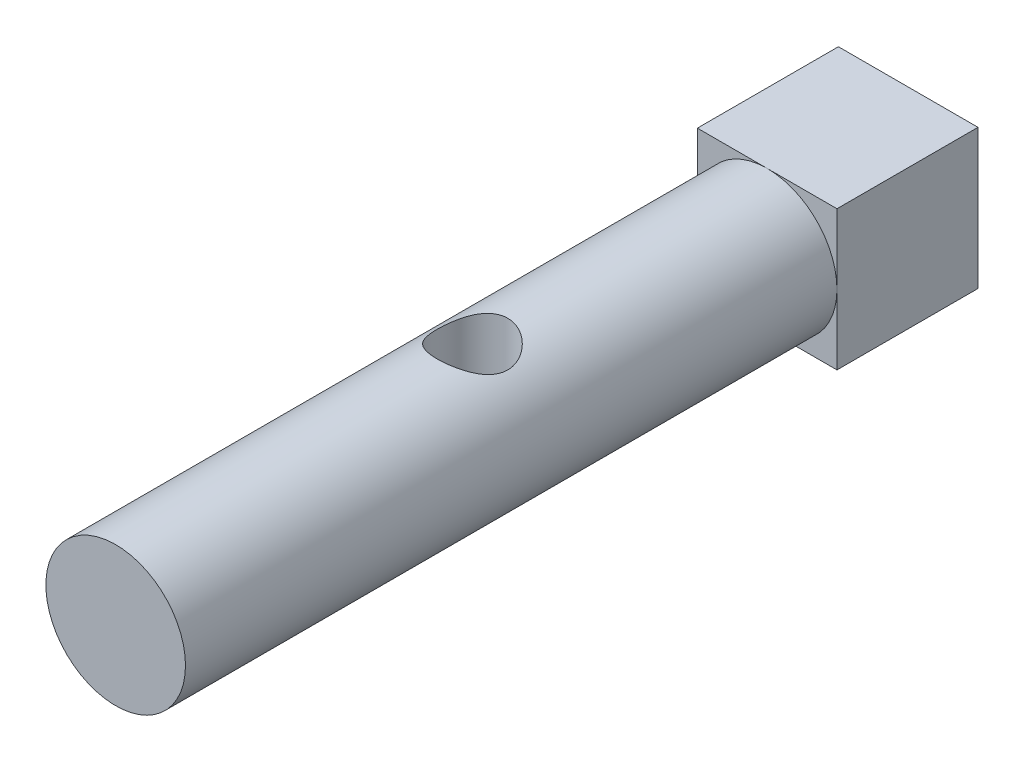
ISO-10303-21;
HEADER;
FILE_DESCRIPTION(('STEP AP214'),'2;1');
FILE_NAME('part.step','',(''),(''),'','','');
FILE_SCHEMA(('AUTOMOTIVE_DESIGN { 1 0 10303 214 1 1 1 1 }'));
ENDSEC;
DATA;
#1=APPLICATION_CONTEXT('core data for automotive mechanical design processes');
#2=APPLICATION_PROTOCOL_DEFINITION('international standard','automotive_design',2000,#1);
#3=PRODUCT_CONTEXT('',#1,'mechanical');
#4=PRODUCT('Part','Part','',(#3));
#5=PRODUCT_RELATED_PRODUCT_CATEGORY('part','',(#4));
#6=PRODUCT_DEFINITION_FORMATION('','',#4);
#7=PRODUCT_DEFINITION_CONTEXT('part definition',#1,'design');
#8=PRODUCT_DEFINITION('design','',#6,#7);
#9=PRODUCT_DEFINITION_SHAPE('','',#8);
#10=(LENGTH_UNIT() NAMED_UNIT(*) SI_UNIT(.MILLI.,.METRE.));
#11=(NAMED_UNIT(*) PLANE_ANGLE_UNIT() SI_UNIT($,.RADIAN.));
#12=(NAMED_UNIT(*) SI_UNIT($,.STERADIAN.) SOLID_ANGLE_UNIT());
#13=UNCERTAINTY_MEASURE_WITH_UNIT(LENGTH_MEASURE(1.E-05),#10,'distance_accuracy_value','');
#14=(GEOMETRIC_REPRESENTATION_CONTEXT(3) GLOBAL_UNCERTAINTY_ASSIGNED_CONTEXT((#13)) GLOBAL_UNIT_ASSIGNED_CONTEXT((#10,
#11,#12)) REPRESENTATION_CONTEXT('',''));
#15=CARTESIAN_POINT('',(0.,0.,0.));
#16=DIRECTION('',(0.,0.,1.));
#17=DIRECTION('',(1.,0.,0.));
#18=AXIS2_PLACEMENT_3D('',#15,#16,#17);
#19=CARTESIAN_POINT('',(0.,0.,46.2));
#20=DIRECTION('',(0.,0.,-1.));
#21=DIRECTION('',(-1.,0.,0.));
#22=AXIS2_PLACEMENT_3D('',#19,#20,#21);
#23=CYLINDRICAL_SURFACE('',#22,4.95);
#24=CARTESIAN_POINT('',(0.,0.,46.2));
#25=DIRECTION('',(0.,0.,1.));
#26=DIRECTION('',(1.,0.,0.));
#27=AXIS2_PLACEMENT_3D('',#24,#25,#26);
#28=CIRCLE('',#27,4.95);
#29=CARTESIAN_POINT('',(4.95,0.,46.2));
#30=VERTEX_POINT('',#29);
#31=EDGE_CURVE('E56',#30,#30,#28,.T.);
#32=ORIENTED_EDGE('',*,*,#31,.F.);
#33=EDGE_LOOP('',(#32));
#34=FACE_BOUND('',#33,.T.);
#35=CARTESIAN_POINT('',(0.,0.,0.));
#36=DIRECTION('',(0.,0.,1.));
#37=DIRECTION('',(1.,0.,0.));
#38=AXIS2_PLACEMENT_3D('',#35,#36,#37);
#39=CIRCLE('',#38,4.95);
#40=CARTESIAN_POINT('',(4.95,0.,0.));
#41=VERTEX_POINT('',#40);
#42=CARTESIAN_POINT('',(0.,4.95,0.));
#43=VERTEX_POINT('',#42);
#44=EDGE_CURVE('E137',#41,#43,#39,.T.);
#45=ORIENTED_EDGE('',*,*,#44,.T.);
#46=CARTESIAN_POINT('',(-4.95,0.,0.));
#47=VERTEX_POINT('',#46);
#48=EDGE_CURVE('E71',#43,#47,#39,.T.);
#49=ORIENTED_EDGE('',*,*,#48,.T.);
#50=CARTESIAN_POINT('',(0.,-4.95,0.));
#51=VERTEX_POINT('',#50);
#52=EDGE_CURVE('E136',#47,#51,#39,.T.);
#53=ORIENTED_EDGE('',*,*,#52,.T.);
#54=EDGE_CURVE('E131',#51,#41,#39,.T.);
#55=ORIENTED_EDGE('',*,*,#54,.T.);
#56=EDGE_LOOP('',(#45,#49,#53,#55));
#57=FACE_BOUND('',#56,.T.);
#58=CARTESIAN_POINT('',(0.,-4.95,18.4));
#59=CARTESIAN_POINT('',(0.131266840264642,-4.94999163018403,18.4000098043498));
#60=CARTESIAN_POINT('',(0.262691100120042,-4.94472218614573,18.4104001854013));
#61=CARTESIAN_POINT('',(0.52164224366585,-4.92415928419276,18.4515008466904));
#62=CARTESIAN_POINT('',(0.649161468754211,-4.90884730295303,18.482248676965));
#63=CARTESIAN_POINT('',(0.896167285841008,-4.86980082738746,18.5625479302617));
#64=CARTESIAN_POINT('',(1.01568317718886,-4.84609930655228,18.6120257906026));
#65=CARTESIAN_POINT('',(1.2445343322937,-4.7924387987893,18.7279947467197));
#66=CARTESIAN_POINT('',(1.3538702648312,-4.76248022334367,18.7944847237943));
#67=CARTESIAN_POINT('',(1.56680440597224,-4.69689097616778,18.9472249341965));
#68=CARTESIAN_POINT('',(1.66963889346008,-4.66102506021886,19.0344373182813));
#69=CARTESIAN_POINT('',(1.85992756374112,-4.58841603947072,19.2240713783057));
#70=CARTESIAN_POINT('',(1.9473697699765,-4.55167227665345,19.3265047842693));
#71=CARTESIAN_POINT('',(2.1113708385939,-4.47809362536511,19.5534373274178));
#72=CARTESIAN_POINT('',(2.18651095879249,-4.4414839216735,19.6790434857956));
#73=CARTESIAN_POINT('',(2.31428309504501,-4.37627389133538,19.9431473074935));
#74=CARTESIAN_POINT('',(2.36693142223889,-4.34766776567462,20.0816355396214));
#75=CARTESIAN_POINT('',(2.44476119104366,-4.3043619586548,20.3590644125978));
#76=CARTESIAN_POINT('',(2.47140889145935,-4.2889270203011,20.4974730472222));
#77=CARTESIAN_POINT('',(2.50095837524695,-4.27177176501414,20.7775851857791));
#78=CARTESIAN_POINT('',(2.50388449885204,-4.27003739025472,20.9192851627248));
#79=CARTESIAN_POINT('',(2.48698236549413,-4.27989017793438,21.1832639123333));
#80=CARTESIAN_POINT('',(2.46990048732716,-4.28986979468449,21.3057933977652));
#81=CARTESIAN_POINT('',(2.41823520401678,-4.31920271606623,21.5459334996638));
#82=CARTESIAN_POINT('',(2.38364603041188,-4.33855911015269,21.6635424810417));
#83=CARTESIAN_POINT('',(2.2973295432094,-4.38488447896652,21.8938636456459));
#84=CARTESIAN_POINT('',(2.24522257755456,-4.4120199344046,22.0063984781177));
#85=CARTESIAN_POINT('',(2.12564350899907,-4.47085852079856,22.2216727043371));
#86=CARTESIAN_POINT('',(2.0581644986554,-4.5025637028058,22.3244076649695));
#87=CARTESIAN_POINT('',(1.89955403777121,-4.57193747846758,22.5311961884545));
#88=CARTESIAN_POINT('',(1.80648987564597,-4.60984613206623,22.6336920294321));
#89=CARTESIAN_POINT('',(1.60435734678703,-4.68402933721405,22.8222785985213));
#90=CARTESIAN_POINT('',(1.49528107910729,-4.72030307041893,22.908361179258));
#91=CARTESIAN_POINT('',(1.25756302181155,-4.78926480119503,23.0655929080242));
#92=CARTESIAN_POINT('',(1.12823094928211,-4.82169519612,23.1358206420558));
#93=CARTESIAN_POINT('',(0.857536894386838,-4.87710504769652,23.2529402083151));
#94=CARTESIAN_POINT('',(0.71618475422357,-4.90009214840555,23.2998509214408));
#95=CARTESIAN_POINT('',(0.438181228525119,-4.93238401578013,23.3650843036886));
#96=CARTESIAN_POINT('',(0.30213110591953,-4.94267525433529,23.3854760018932));
#97=CARTESIAN_POINT('',(0.0281715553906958,-4.95181311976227,23.4036020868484));
#98=CARTESIAN_POINT('',(-0.109736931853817,-4.95066533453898,23.401347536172));
#99=CARTESIAN_POINT('',(-0.371843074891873,-4.9376202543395,23.3754180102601));
#100=CARTESIAN_POINT('',(-0.49625967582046,-4.92658406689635,23.3534587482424));
#101=CARTESIAN_POINT('',(-0.73938404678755,-4.89600136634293,23.291454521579));
#102=CARTESIAN_POINT('',(-0.858091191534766,-4.87645392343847,23.2514075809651));
#103=CARTESIAN_POINT('',(-1.09030613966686,-4.8299233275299,23.1533465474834));
#104=CARTESIAN_POINT('',(-1.2035735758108,-4.80274638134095,23.0948584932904));
#105=CARTESIAN_POINT('',(-1.41905476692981,-4.74355240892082,22.9621146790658));
#106=CARTESIAN_POINT('',(-1.52126383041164,-4.71153334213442,22.8878522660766));
#107=CARTESIAN_POINT('',(-1.72253892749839,-4.64196040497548,22.7171313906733));
#108=CARTESIAN_POINT('',(-1.82027549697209,-4.60417299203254,22.6191981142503));
#109=CARTESIAN_POINT('',(-1.99854026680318,-4.52964582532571,22.4082848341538));
#110=CARTESIAN_POINT('',(-2.07905596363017,-4.49290684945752,22.2952939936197));
#111=CARTESIAN_POINT('',(-2.22448661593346,-4.42278373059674,22.0502060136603));
#112=CARTESIAN_POINT('',(-2.28839379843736,-4.38966705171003,21.9174274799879));
#113=CARTESIAN_POINT('',(-2.39227317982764,-4.3339420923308,21.6407979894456));
#114=CARTESIAN_POINT('',(-2.43227681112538,-4.31132002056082,21.4969618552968));
#115=CARTESIAN_POINT('',(-2.48347550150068,-4.28201380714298,21.2171428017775));
#116=CARTESIAN_POINT('',(-2.4970797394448,-4.27400139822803,21.0817430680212));
#117=CARTESIAN_POINT('',(-2.50207080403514,-4.27108454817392,20.8104190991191));
#118=CARTESIAN_POINT('',(-2.49346793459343,-4.27617402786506,20.6744951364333));
#119=CARTESIAN_POINT('',(-2.45655227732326,-4.29746659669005,20.4201883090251));
#120=CARTESIAN_POINT('',(-2.4302750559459,-4.31251957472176,20.3014010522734));
#121=CARTESIAN_POINT('',(-2.36131008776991,-4.35066181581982,20.0700640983));
#122=CARTESIAN_POINT('',(-2.31861697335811,-4.37375370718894,19.9575164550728));
#123=CARTESIAN_POINT('',(-2.21483814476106,-4.42725742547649,19.7334909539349));
#124=CARTESIAN_POINT('',(-2.1527113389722,-4.45805617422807,19.6225905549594));
#125=CARTESIAN_POINT('',(-2.01296296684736,-4.52287682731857,19.4120599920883));
#126=CARTESIAN_POINT('',(-1.93533325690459,-4.55690042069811,19.3124357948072));
#127=CARTESIAN_POINT('',(-1.75541032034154,-4.62942291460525,19.1143378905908));
#128=CARTESIAN_POINT('',(-1.65124768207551,-4.6679500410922,19.0175618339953));
#129=CARTESIAN_POINT('',(-1.42716227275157,-4.74126842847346,18.8424645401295));
#130=CARTESIAN_POINT('',(-1.30723085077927,-4.77605761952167,18.7641534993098));
#131=CARTESIAN_POINT('',(-1.05286786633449,-4.83851121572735,18.6279065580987));
#132=CARTESIAN_POINT('',(-0.91831122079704,-4.8661059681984,18.5701679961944));
#133=CARTESIAN_POINT('',(-0.709589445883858,-4.89938589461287,18.5016962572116));
#134=CARTESIAN_POINT('',(-0.638918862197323,-4.90912324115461,18.4819024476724));
#135=CARTESIAN_POINT('',(-0.49579553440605,-4.92563264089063,18.4485571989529));
#136=CARTESIAN_POINT('',(-0.423343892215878,-4.93240648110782,18.4350019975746));
#137=CARTESIAN_POINT('',(-0.292418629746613,-4.94169659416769,18.4164713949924));
#138=CARTESIAN_POINT('',(-0.234152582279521,-4.94480361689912,18.4103014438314));
#139=CARTESIAN_POINT('',(-0.117268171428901,-4.94895721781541,18.4020634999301));
#140=CARTESIAN_POINT('',(-0.0586497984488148,-4.95000373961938,18.3999956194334));
#141=CARTESIAN_POINT('',(0.,-4.95,18.4));
#142=B_SPLINE_CURVE_WITH_KNOTS('',3,(#58,#59,#60,#61,#62,#63,#64,#65,#66,#67,#68,#69,#70,#71,
#72,#73,#74,#75,#76,#77,#78,#79,#80,#81,#82,#83,#84,#85,#86,#87,#88,#89,#90,#91,#92,#93,#94,#95,
#96,#97,#98,#99,#100,#101,#102,#103,#104,#105,#106,#107,#108,#109,#110,#111,#112,#113,#114,#115,
#116,#117,#118,#119,#120,#121,#122,#123,#124,#125,#126,#127,#128,#129,#130,#131,#132,#133,#134,
#135,#136,#137,#138,#139,#140,#141),.UNSPECIFIED.,.T.,.F.,(4,2,2,2,2,2,2,2,2,2,2,2,2,2,2,2,2,2,
2,2,2,2,2,2,2,2,2,2,2,2,2,2,2,2,2,2,2,2,2,2,2,4),(0.,0.393572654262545,0.787873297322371,
1.18064111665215,1.5733831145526,1.99022374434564,2.40738729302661,2.85772981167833,
3.30774518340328,3.73059394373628,4.1530087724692,4.52362263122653,4.89435868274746,
5.27371167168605,5.65323546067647,6.08199139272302,6.51095960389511,6.96063421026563,
7.40994409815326,7.8215415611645,8.23293797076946,8.61165594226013,8.99041529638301,
9.37983479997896,9.76941887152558,10.1978467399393,10.6265846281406,11.077236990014,
11.5272954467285,11.9338874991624,12.3402909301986,12.7064610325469,13.0727509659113,
13.4635949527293,13.8546447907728,14.2945339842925,14.7346655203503,15.1789119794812,
15.4007292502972,15.6224125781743,15.7982553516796,15.9741029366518),.UNSPECIFIED.);
#143=CARTESIAN_POINT('',(0.,-4.95,18.4));
#144=VERTEX_POINT('',#143);
#145=EDGE_CURVE('E11',#144,#144,#142,.T.);
#146=ORIENTED_EDGE('',*,*,#145,.F.);
#147=EDGE_LOOP('',(#146));
#148=FACE_BOUND('',#147,.T.);
#149=CARTESIAN_POINT('',(0.,4.95,18.4));
#150=CARTESIAN_POINT('',(0.131266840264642,4.94999163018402,18.4000098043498));
#151=CARTESIAN_POINT('',(0.262691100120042,4.94472218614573,18.4104001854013));
#152=CARTESIAN_POINT('',(0.521642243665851,4.92415928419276,18.4515008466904));
#153=CARTESIAN_POINT('',(0.649161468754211,4.90884730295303,18.482248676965));
#154=CARTESIAN_POINT('',(0.896167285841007,4.86980082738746,18.5625479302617));
#155=CARTESIAN_POINT('',(1.01568317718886,4.84609930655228,18.6120257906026));
#156=CARTESIAN_POINT('',(1.2445343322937,4.7924387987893,18.7279947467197));
#157=CARTESIAN_POINT('',(1.3538702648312,4.76248022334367,18.7944847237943));
#158=CARTESIAN_POINT('',(1.56680440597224,4.69689097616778,18.9472249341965));
#159=CARTESIAN_POINT('',(1.66963889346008,4.66102506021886,19.0344373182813));
#160=CARTESIAN_POINT('',(1.85992756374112,4.58841603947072,19.2240713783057));
#161=CARTESIAN_POINT('',(1.9473697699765,4.55167227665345,19.3265047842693));
#162=CARTESIAN_POINT('',(2.1113708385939,4.47809362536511,19.5534373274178));
#163=CARTESIAN_POINT('',(2.18651095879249,4.4414839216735,19.6790434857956));
#164=CARTESIAN_POINT('',(2.31428309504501,4.37627389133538,19.9431473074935));
#165=CARTESIAN_POINT('',(2.36693142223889,4.34766776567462,20.0816355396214));
#166=CARTESIAN_POINT('',(2.44476119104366,4.3043619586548,20.3590644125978));
#167=CARTESIAN_POINT('',(2.47140889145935,4.2889270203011,20.4974730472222));
#168=CARTESIAN_POINT('',(2.50095837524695,4.27177176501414,20.7775851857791));
#169=CARTESIAN_POINT('',(2.50388449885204,4.27003739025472,20.9192851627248));
#170=CARTESIAN_POINT('',(2.48698236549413,4.27989017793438,21.1832639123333));
#171=CARTESIAN_POINT('',(2.46990048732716,4.28986979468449,21.3057933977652));
#172=CARTESIAN_POINT('',(2.41823520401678,4.31920271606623,21.5459334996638));
#173=CARTESIAN_POINT('',(2.38364603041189,4.33855911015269,21.6635424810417));
#174=CARTESIAN_POINT('',(2.2973295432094,4.38488447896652,21.8938636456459));
#175=CARTESIAN_POINT('',(2.24522257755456,4.4120199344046,22.0063984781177));
#176=CARTESIAN_POINT('',(2.12564350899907,4.47085852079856,22.2216727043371));
#177=CARTESIAN_POINT('',(2.0581644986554,4.5025637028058,22.3244076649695));
#178=CARTESIAN_POINT('',(1.89955403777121,4.57193747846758,22.5311961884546));
#179=CARTESIAN_POINT('',(1.80648987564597,4.60984613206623,22.6336920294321));
#180=CARTESIAN_POINT('',(1.60435734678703,4.68402933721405,22.8222785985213));
#181=CARTESIAN_POINT('',(1.49528107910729,4.72030307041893,22.908361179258));
#182=CARTESIAN_POINT('',(1.25756302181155,4.78926480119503,23.0655929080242));
#183=CARTESIAN_POINT('',(1.12823094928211,4.82169519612,23.1358206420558));
#184=CARTESIAN_POINT('',(0.857536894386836,4.87710504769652,23.252940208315));
#185=CARTESIAN_POINT('',(0.716184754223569,4.90009214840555,23.2998509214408));
#186=CARTESIAN_POINT('',(0.438181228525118,4.93238401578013,23.3650843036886));
#187=CARTESIAN_POINT('',(0.302131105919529,4.94267525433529,23.3854760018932));
#188=CARTESIAN_POINT('',(0.0281715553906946,4.95181311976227,23.4036020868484));
#189=CARTESIAN_POINT('',(-0.109736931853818,4.95066533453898,23.401347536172));
#190=CARTESIAN_POINT('',(-0.371843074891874,4.9376202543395,23.3754180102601));
#191=CARTESIAN_POINT('',(-0.496259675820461,4.92658406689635,23.3534587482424));
#192=CARTESIAN_POINT('',(-0.739384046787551,4.89600136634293,23.291454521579));
#193=CARTESIAN_POINT('',(-0.858091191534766,4.87645392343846,23.2514075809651));
#194=CARTESIAN_POINT('',(-1.09030613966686,4.8299233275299,23.1533465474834));
#195=CARTESIAN_POINT('',(-1.2035735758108,4.80274638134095,23.0948584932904));
#196=CARTESIAN_POINT('',(-1.41905476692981,4.74355240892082,22.9621146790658));
#197=CARTESIAN_POINT('',(-1.52126383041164,4.71153334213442,22.8878522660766));
#198=CARTESIAN_POINT('',(-1.72253892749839,4.64196040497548,22.7171313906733));
#199=CARTESIAN_POINT('',(-1.82027549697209,4.60417299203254,22.6191981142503));
#200=CARTESIAN_POINT('',(-1.99854026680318,4.52964582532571,22.4082848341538));
#201=CARTESIAN_POINT('',(-2.07905596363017,4.49290684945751,22.2952939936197));
#202=CARTESIAN_POINT('',(-2.22448661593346,4.42278373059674,22.0502060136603));
#203=CARTESIAN_POINT('',(-2.28839379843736,4.38966705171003,21.9174274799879));
#204=CARTESIAN_POINT('',(-2.39227317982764,4.3339420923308,21.6407979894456));
#205=CARTESIAN_POINT('',(-2.43227681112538,4.31132002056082,21.4969618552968));
#206=CARTESIAN_POINT('',(-2.48347550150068,4.28201380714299,21.2171428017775));
#207=CARTESIAN_POINT('',(-2.4970797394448,4.27400139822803,21.0817430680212));
#208=CARTESIAN_POINT('',(-2.50207080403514,4.27108454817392,20.8104190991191));
#209=CARTESIAN_POINT('',(-2.49346793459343,4.27617402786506,20.6744951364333));
#210=CARTESIAN_POINT('',(-2.45655227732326,4.29746659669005,20.4201883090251));
#211=CARTESIAN_POINT('',(-2.4302750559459,4.31251957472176,20.3014010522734));
#212=CARTESIAN_POINT('',(-2.36131008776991,4.35066181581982,20.0700640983));
#213=CARTESIAN_POINT('',(-2.31861697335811,4.37375370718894,19.9575164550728));
#214=CARTESIAN_POINT('',(-2.21483814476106,4.42725742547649,19.7334909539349));
#215=CARTESIAN_POINT('',(-2.1527113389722,4.45805617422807,19.6225905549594));
#216=CARTESIAN_POINT('',(-2.01296296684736,4.52287682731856,19.4120599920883));
#217=CARTESIAN_POINT('',(-1.93533325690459,4.55690042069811,19.3124357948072));
#218=CARTESIAN_POINT('',(-1.75541032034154,4.62942291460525,19.1143378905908));
#219=CARTESIAN_POINT('',(-1.65124768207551,4.6679500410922,19.0175618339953));
#220=CARTESIAN_POINT('',(-1.42716227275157,4.74126842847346,18.8424645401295));
#221=CARTESIAN_POINT('',(-1.30723085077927,4.77605761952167,18.7641534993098));
#222=CARTESIAN_POINT('',(-1.05286786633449,4.83851121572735,18.6279065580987));
#223=CARTESIAN_POINT('',(-0.918311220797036,4.8661059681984,18.5701679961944));
#224=CARTESIAN_POINT('',(-0.709589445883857,4.89938589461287,18.5016962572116));
#225=CARTESIAN_POINT('',(-0.638918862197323,4.90912324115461,18.4819024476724));
#226=CARTESIAN_POINT('',(-0.49579553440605,4.92563264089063,18.4485571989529));
#227=CARTESIAN_POINT('',(-0.423343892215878,4.93240648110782,18.4350019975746));
#228=CARTESIAN_POINT('',(-0.292418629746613,4.94169659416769,18.4164713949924));
#229=CARTESIAN_POINT('',(-0.234152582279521,4.94480361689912,18.4103014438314));
#230=CARTESIAN_POINT('',(-0.117268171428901,4.94895721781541,18.4020634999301));
#231=CARTESIAN_POINT('',(-0.058649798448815,4.95000373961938,18.3999956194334));
#232=CARTESIAN_POINT('',(0.,4.95,18.4));
#233=B_SPLINE_CURVE_WITH_KNOTS('',3,(#149,#150,#151,#152,#153,#154,#155,#156,#157,#158,#159,
#160,#161,#162,#163,#164,#165,#166,#167,#168,#169,#170,#171,#172,#173,#174,#175,#176,#177,#178,
#179,#180,#181,#182,#183,#184,#185,#186,#187,#188,#189,#190,#191,#192,#193,#194,#195,#196,#197,
#198,#199,#200,#201,#202,#203,#204,#205,#206,#207,#208,#209,#210,#211,#212,#213,#214,#215,#216,
#217,#218,#219,#220,#221,#222,#223,#224,#225,#226,#227,#228,#229,#230,#231,#232),.UNSPECIFIED.,
.T.,.F.,(4,2,2,2,2,2,2,2,2,2,2,2,2,2,2,2,2,2,2,2,2,2,2,2,2,2,2,2,2,2,2,2,2,2,2,2,2,2,2,2,2,4),
(0.,0.393572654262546,0.787873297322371,1.18064111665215,1.5733831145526,1.99022374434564,
2.40738729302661,2.85772981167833,3.30774518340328,3.73059394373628,4.1530087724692,
4.52362263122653,4.89435868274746,5.27371167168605,5.65323546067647,6.08199139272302,
6.51095960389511,6.96063421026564,7.40994409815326,7.8215415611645,8.23293797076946,
8.61165594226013,8.99041529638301,9.37983479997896,9.76941887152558,10.1978467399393,
10.6265846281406,11.077236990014,11.5272954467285,11.9338874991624,12.3402909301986,
12.7064610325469,13.0727509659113,13.4635949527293,13.8546447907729,14.2945339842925,
14.7346655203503,15.1789119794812,15.4007292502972,15.6224125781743,15.7982553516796,
15.9741029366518),.UNSPECIFIED.);
#234=CARTESIAN_POINT('',(0.,4.95,18.4));
#235=VERTEX_POINT('',#234);
#236=EDGE_CURVE('E162',#235,#235,#233,.T.);
#237=ORIENTED_EDGE('',*,*,#236,.T.);
#238=EDGE_LOOP('',(#237));
#239=FACE_BOUND('',#238,.T.);
#240=ADVANCED_FACE('F43',(#34,#57,#148,#239),#23,.T.);
#241=CARTESIAN_POINT('',(0.,0.,46.2));
#242=DIRECTION('',(0.,0.,1.));
#243=DIRECTION('',(1.,0.,0.));
#244=AXIS2_PLACEMENT_3D('',#241,#242,#243);
#245=PLANE('',#244);
#246=ORIENTED_EDGE('',*,*,#31,.T.);
#247=EDGE_LOOP('',(#246));
#248=FACE_BOUND('',#247,.T.);
#249=ADVANCED_FACE('F211',(#248),#245,.T.);
#250=CARTESIAN_POINT('',(0.,0.,0.));
#251=DIRECTION('',(0.,0.,1.));
#252=DIRECTION('',(1.,0.,0.));
#253=AXIS2_PLACEMENT_3D('',#250,#251,#252);
#254=PLANE('',#253);
#255=ORIENTED_EDGE('',*,*,#44,.F.);
#256=DIRECTION('',(0.,-1.,0.));
#257=VECTOR('',#256,1.);
#258=CARTESIAN_POINT('',(4.95,4.95,0.));
#259=LINE('',#258,#257);
#260=CARTESIAN_POINT('',(4.95,4.95,0.));
#261=VERTEX_POINT('',#260);
#262=EDGE_CURVE('E63',#261,#41,#259,.T.);
#263=ORIENTED_EDGE('',*,*,#262,.F.);
#264=DIRECTION('',(1.,0.,0.));
#265=VECTOR('',#264,1.);
#266=CARTESIAN_POINT('',(-4.95,4.95,0.));
#267=LINE('',#266,#265);
#268=EDGE_CURVE('E166',#43,#261,#267,.T.);
#269=ORIENTED_EDGE('',*,*,#268,.F.);
#270=EDGE_LOOP('',(#255,#263,#269));
#271=FACE_BOUND('',#270,.T.);
#272=ADVANCED_FACE('F189',(#271),#254,.T.);
#273=ORIENTED_EDGE('',*,*,#48,.F.);
#274=CARTESIAN_POINT('',(-4.95,4.95,0.));
#275=VERTEX_POINT('',#274);
#276=EDGE_CURVE('E160',#275,#43,#267,.T.);
#277=ORIENTED_EDGE('',*,*,#276,.F.);
#278=DIRECTION('',(0.,1.,0.));
#279=VECTOR('',#278,1.);
#280=CARTESIAN_POINT('',(-4.95,4.95,0.));
#281=LINE('',#280,#279);
#282=EDGE_CURVE('E129',#47,#275,#281,.T.);
#283=ORIENTED_EDGE('',*,*,#282,.F.);
#284=EDGE_LOOP('',(#273,#277,#283));
#285=FACE_BOUND('',#284,.T.);
#286=ADVANCED_FACE('F159',(#285),#254,.T.);
#287=ORIENTED_EDGE('',*,*,#52,.F.);
#288=CARTESIAN_POINT('',(-4.95,-4.95,0.));
#289=VERTEX_POINT('',#288);
#290=EDGE_CURVE('E156',#289,#47,#281,.T.);
#291=ORIENTED_EDGE('',*,*,#290,.F.);
#292=DIRECTION('',(-1.,0.,0.));
#293=VECTOR('',#292,1.);
#294=CARTESIAN_POINT('',(-4.95,-4.95,0.));
#295=LINE('',#294,#293);
#296=EDGE_CURVE('E157',#51,#289,#295,.T.);
#297=ORIENTED_EDGE('',*,*,#296,.F.);
#298=EDGE_LOOP('',(#287,#291,#297));
#299=FACE_BOUND('',#298,.T.);
#300=ADVANCED_FACE('F155',(#299),#254,.T.);
#301=ORIENTED_EDGE('',*,*,#54,.F.);
#302=CARTESIAN_POINT('',(4.95,-4.95,0.));
#303=VERTEX_POINT('',#302);
#304=EDGE_CURVE('E125',#303,#51,#295,.T.);
#305=ORIENTED_EDGE('',*,*,#304,.F.);
#306=EDGE_CURVE('E173',#41,#303,#259,.T.);
#307=ORIENTED_EDGE('',*,*,#306,.F.);
#308=EDGE_LOOP('',(#301,#305,#307));
#309=FACE_BOUND('',#308,.T.);
#310=ADVANCED_FACE('F186',(#309),#254,.T.);
#311=CARTESIAN_POINT('',(-4.95,4.95,-10.));
#312=DIRECTION('',(1.,0.,0.));
#313=DIRECTION('',(0.,1.,0.));
#314=AXIS2_PLACEMENT_3D('',#311,#312,#313);
#315=PLANE('',#314);
#316=ORIENTED_EDGE('',*,*,#290,.T.);
#317=ORIENTED_EDGE('',*,*,#282,.T.);
#318=DIRECTION('',(0.,0.,1.));
#319=VECTOR('',#318,1.);
#320=CARTESIAN_POINT('',(-4.95,4.95,-10.));
#321=LINE('',#320,#319);
#322=CARTESIAN_POINT('',(-4.95,4.95,-10.));
#323=VERTEX_POINT('',#322);
#324=EDGE_CURVE('E109',#323,#275,#321,.T.);
#325=ORIENTED_EDGE('',*,*,#324,.F.);
#326=DIRECTION('',(0.,1.,0.));
#327=VECTOR('',#326,1.);
#328=CARTESIAN_POINT('',(-4.95,4.95,-10.));
#329=LINE('',#328,#327);
#330=CARTESIAN_POINT('',(-4.95,-4.95,-10.));
#331=VERTEX_POINT('',#330);
#332=EDGE_CURVE('E115',#331,#323,#329,.T.);
#333=ORIENTED_EDGE('',*,*,#332,.F.);
#334=DIRECTION('',(0.,0.,1.));
#335=VECTOR('',#334,1.);
#336=CARTESIAN_POINT('',(-4.95,-4.95,-10.));
#337=LINE('',#336,#335);
#338=EDGE_CURVE('E164',#331,#289,#337,.T.);
#339=ORIENTED_EDGE('',*,*,#338,.T.);
#340=EDGE_LOOP('',(#316,#317,#325,#333,#339));
#341=FACE_BOUND('',#340,.T.);
#342=ADVANCED_FACE('F128',(#341),#315,.F.);
#343=CARTESIAN_POINT('',(-4.95,4.95,-10.));
#344=DIRECTION('',(0.,-1.,0.));
#345=DIRECTION('',(1.,0.,0.));
#346=AXIS2_PLACEMENT_3D('',#343,#344,#345);
#347=PLANE('',#346);
#348=ORIENTED_EDGE('',*,*,#276,.T.);
#349=ORIENTED_EDGE('',*,*,#268,.T.);
#350=DIRECTION('',(0.,0.,1.));
#351=VECTOR('',#350,1.);
#352=CARTESIAN_POINT('',(4.95,4.95,-10.));
#353=LINE('',#352,#351);
#354=CARTESIAN_POINT('',(4.95,4.95,-10.));
#355=VERTEX_POINT('',#354);
#356=EDGE_CURVE('E110',#355,#261,#353,.T.);
#357=ORIENTED_EDGE('',*,*,#356,.F.);
#358=DIRECTION('',(1.,0.,0.));
#359=VECTOR('',#358,1.);
#360=CARTESIAN_POINT('',(-4.95,4.95,-10.));
#361=LINE('',#360,#359);
#362=EDGE_CURVE('E104',#323,#355,#361,.T.);
#363=ORIENTED_EDGE('',*,*,#362,.F.);
#364=ORIENTED_EDGE('',*,*,#324,.T.);
#365=EDGE_LOOP('',(#348,#349,#357,#363,#364));
#366=FACE_BOUND('',#365,.T.);
#367=ADVANCED_FACE('F107',(#366),#347,.F.);
#368=CARTESIAN_POINT('',(4.95,4.95,-10.));
#369=DIRECTION('',(-1.,0.,0.));
#370=DIRECTION('',(0.,-1.,0.));
#371=AXIS2_PLACEMENT_3D('',#368,#369,#370);
#372=PLANE('',#371);
#373=ORIENTED_EDGE('',*,*,#262,.T.);
#374=ORIENTED_EDGE('',*,*,#306,.T.);
#375=DIRECTION('',(0.,0.,1.));
#376=VECTOR('',#375,1.);
#377=CARTESIAN_POINT('',(4.95,-4.95,-10.));
#378=LINE('',#377,#376);
#379=CARTESIAN_POINT('',(4.95,-4.95,-10.));
#380=VERTEX_POINT('',#379);
#381=EDGE_CURVE('E138',#380,#303,#378,.T.);
#382=ORIENTED_EDGE('',*,*,#381,.F.);
#383=DIRECTION('',(0.,-1.,0.));
#384=VECTOR('',#383,1.);
#385=CARTESIAN_POINT('',(4.95,4.95,-10.));
#386=LINE('',#385,#384);
#387=EDGE_CURVE('E114',#355,#380,#386,.T.);
#388=ORIENTED_EDGE('',*,*,#387,.F.);
#389=ORIENTED_EDGE('',*,*,#356,.T.);
#390=EDGE_LOOP('',(#373,#374,#382,#388,#389));
#391=FACE_BOUND('',#390,.T.);
#392=ADVANCED_FACE('F190',(#391),#372,.F.);
#393=CARTESIAN_POINT('',(-4.95,-4.95,-10.));
#394=DIRECTION('',(0.,1.,0.));
#395=DIRECTION('',(-1.,0.,0.));
#396=AXIS2_PLACEMENT_3D('',#393,#394,#395);
#397=PLANE('',#396);
#398=ORIENTED_EDGE('',*,*,#304,.T.);
#399=ORIENTED_EDGE('',*,*,#296,.T.);
#400=ORIENTED_EDGE('',*,*,#338,.F.);
#401=DIRECTION('',(-1.,0.,0.));
#402=VECTOR('',#401,1.);
#403=CARTESIAN_POINT('',(-4.95,-4.95,-10.));
#404=LINE('',#403,#402);
#405=EDGE_CURVE('E120',#380,#331,#404,.T.);
#406=ORIENTED_EDGE('',*,*,#405,.F.);
#407=ORIENTED_EDGE('',*,*,#381,.T.);
#408=EDGE_LOOP('',(#398,#399,#400,#406,#407));
#409=FACE_BOUND('',#408,.T.);
#410=ADVANCED_FACE('F184',(#409),#397,.F.);
#411=CARTESIAN_POINT('',(0.,0.,-10.));
#412=DIRECTION('',(0.,0.,1.));
#413=DIRECTION('',(1.,0.,0.));
#414=AXIS2_PLACEMENT_3D('',#411,#412,#413);
#415=PLANE('',#414);
#416=ORIENTED_EDGE('',*,*,#332,.T.);
#417=ORIENTED_EDGE('',*,*,#362,.T.);
#418=ORIENTED_EDGE('',*,*,#387,.T.);
#419=ORIENTED_EDGE('',*,*,#405,.T.);
#420=EDGE_LOOP('',(#416,#417,#418,#419));
#421=FACE_BOUND('',#420,.T.);
#422=ADVANCED_FACE('F118',(#421),#415,.F.);
#423=CARTESIAN_POINT('',(0.,4.951,20.9));
#424=DIRECTION('',(0.,-1.,0.));
#425=DIRECTION('',(0.,0.,-1.));
#426=AXIS2_PLACEMENT_3D('',#423,#424,#425);
#427=CYLINDRICAL_SURFACE('',#426,2.5);
#428=ORIENTED_EDGE('',*,*,#236,.F.);
#429=EDGE_LOOP('',(#428));
#430=FACE_BOUND('',#429,.T.);
#431=ORIENTED_EDGE('',*,*,#145,.T.);
#432=EDGE_LOOP('',(#431));
#433=FACE_BOUND('',#432,.T.);
#434=ADVANCED_FACE('F200',(#430,#433),#427,.F.);
#435=CLOSED_SHELL('',(#240,#249,#272,#286,#300,#310,#342,#367,#392,#410,#422,#434));
#436=MANIFOLD_SOLID_BREP('B2',#435);
#437=ADVANCED_BREP_SHAPE_REPRESENTATION('',(#18,#436),#14);
#438=SHAPE_DEFINITION_REPRESENTATION(#9,#437);
ENDSEC;
END-ISO-10303-21;
